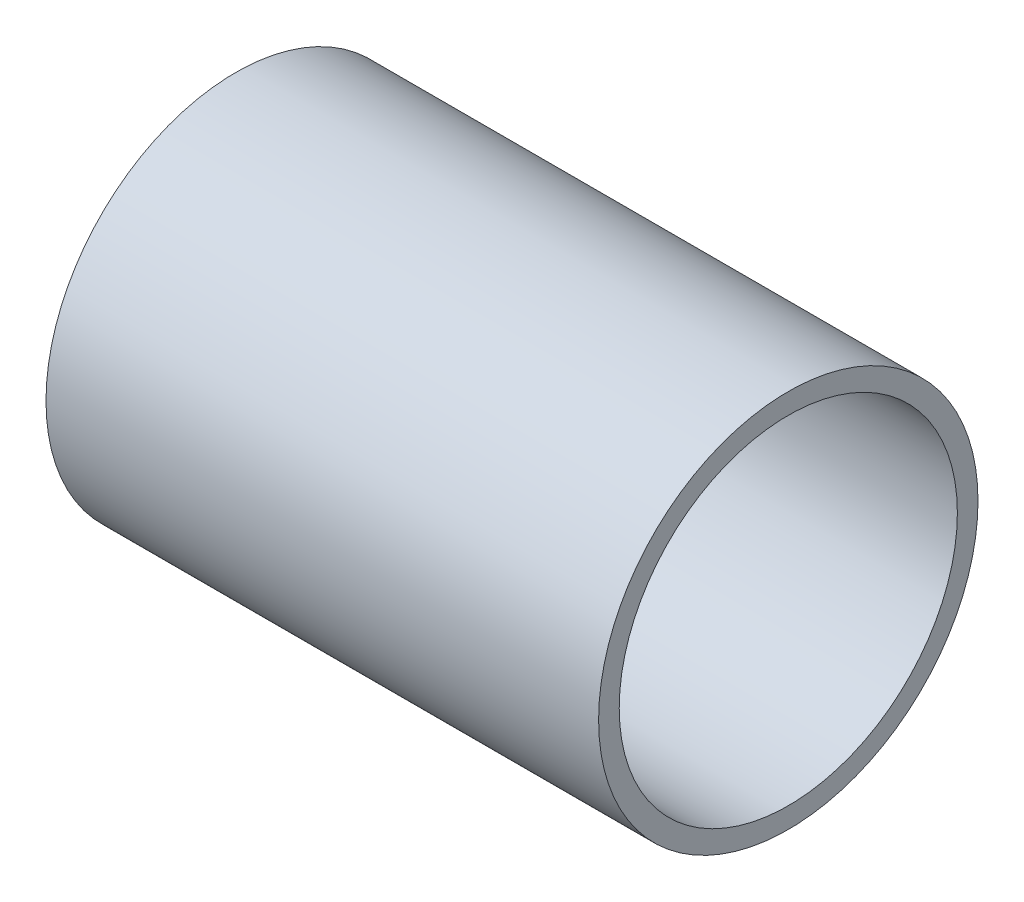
ISO-10303-21;
HEADER;
FILE_DESCRIPTION(('STEP AP214'),'2;1');
FILE_NAME('part.step','',(''),(''),'','','');
FILE_SCHEMA(('AUTOMOTIVE_DESIGN { 1 0 10303 214 1 1 1 1 }'));
ENDSEC;
DATA;
#1=APPLICATION_CONTEXT('core data for automotive mechanical design processes');
#2=APPLICATION_PROTOCOL_DEFINITION('international standard','automotive_design',2000,#1);
#3=PRODUCT_CONTEXT('',#1,'mechanical');
#4=PRODUCT('Part','Part','',(#3));
#5=PRODUCT_RELATED_PRODUCT_CATEGORY('part','',(#4));
#6=PRODUCT_DEFINITION_FORMATION('','',#4);
#7=PRODUCT_DEFINITION_CONTEXT('part definition',#1,'design');
#8=PRODUCT_DEFINITION('design','',#6,#7);
#9=PRODUCT_DEFINITION_SHAPE('','',#8);
#10=(LENGTH_UNIT() NAMED_UNIT(*) SI_UNIT(.MILLI.,.METRE.));
#11=(NAMED_UNIT(*) PLANE_ANGLE_UNIT() SI_UNIT($,.RADIAN.));
#12=(NAMED_UNIT(*) SI_UNIT($,.STERADIAN.) SOLID_ANGLE_UNIT());
#13=UNCERTAINTY_MEASURE_WITH_UNIT(LENGTH_MEASURE(1.E-05),#10,'distance_accuracy_value','');
#14=(GEOMETRIC_REPRESENTATION_CONTEXT(3) GLOBAL_UNCERTAINTY_ASSIGNED_CONTEXT((#13)) GLOBAL_UNIT_ASSIGNED_CONTEXT((#10,
#11,#12)) REPRESENTATION_CONTEXT('',''));
#15=CARTESIAN_POINT('',(0.,0.,0.));
#16=DIRECTION('',(0.,0.,1.));
#17=DIRECTION('',(1.,0.,0.));
#18=AXIS2_PLACEMENT_3D('',#15,#16,#17);
#19=CARTESIAN_POINT('',(67.,0.,0.));
#20=DIRECTION('',(1.,0.,0.));
#21=DIRECTION('',(0.,0.,-1.));
#22=AXIS2_PLACEMENT_3D('',#19,#20,#21);
#23=PLANE('',#22);
#24=CARTESIAN_POINT('',(67.,0.,0.));
#25=DIRECTION('',(1.,0.,0.));
#26=DIRECTION('',(0.,0.,-1.));
#27=AXIS2_PLACEMENT_3D('',#24,#25,#26);
#28=CIRCLE('',#27,23.);
#29=CARTESIAN_POINT('',(67.,0.,-23.));
#30=VERTEX_POINT('',#29);
#31=EDGE_CURVE('E10',#30,#30,#28,.T.);
#32=ORIENTED_EDGE('',*,*,#31,.T.);
#33=EDGE_LOOP('',(#32));
#34=FACE_BOUND('',#33,.T.);
#35=CARTESIAN_POINT('',(67.,0.,0.));
#36=DIRECTION('',(1.,0.,0.));
#37=DIRECTION('',(0.,0.,-1.));
#38=AXIS2_PLACEMENT_3D('',#35,#36,#37);
#39=CIRCLE('',#38,20.5);
#40=CARTESIAN_POINT('',(67.,0.,-20.5));
#41=VERTEX_POINT('',#40);
#42=EDGE_CURVE('E38',#41,#41,#39,.T.);
#43=ORIENTED_EDGE('',*,*,#42,.F.);
#44=EDGE_LOOP('',(#43));
#45=FACE_BOUND('',#44,.T.);
#46=ADVANCED_FACE('F27',(#34,#45),#23,.T.);
#47=CARTESIAN_POINT('',(0.,0.,0.));
#48=DIRECTION('',(1.,0.,0.));
#49=DIRECTION('',(0.,0.,-1.));
#50=AXIS2_PLACEMENT_3D('',#47,#48,#49);
#51=PLANE('',#50);
#52=CARTESIAN_POINT('',(0.,0.,0.));
#53=DIRECTION('',(1.,0.,0.));
#54=DIRECTION('',(0.,0.,-1.));
#55=AXIS2_PLACEMENT_3D('',#52,#53,#54);
#56=CIRCLE('',#55,23.);
#57=CARTESIAN_POINT('',(0.,0.,-23.));
#58=VERTEX_POINT('',#57);
#59=EDGE_CURVE('E34',#58,#58,#56,.T.);
#60=ORIENTED_EDGE('',*,*,#59,.F.);
#61=EDGE_LOOP('',(#60));
#62=FACE_BOUND('',#61,.T.);
#63=CARTESIAN_POINT('',(0.,0.,0.));
#64=DIRECTION('',(1.,0.,0.));
#65=DIRECTION('',(0.,0.,-1.));
#66=AXIS2_PLACEMENT_3D('',#63,#64,#65);
#67=CIRCLE('',#66,20.5);
#68=CARTESIAN_POINT('',(0.,0.,-20.5));
#69=VERTEX_POINT('',#68);
#70=EDGE_CURVE('E42',#69,#69,#67,.T.);
#71=ORIENTED_EDGE('',*,*,#70,.T.);
#72=EDGE_LOOP('',(#71));
#73=FACE_BOUND('',#72,.T.);
#74=ADVANCED_FACE('F48',(#62,#73),#51,.F.);
#75=CARTESIAN_POINT('',(67.,0.,0.));
#76=DIRECTION('',(-1.,0.,0.));
#77=DIRECTION('',(0.,0.,1.));
#78=AXIS2_PLACEMENT_3D('',#75,#76,#77);
#79=CYLINDRICAL_SURFACE('',#78,23.);
#80=ORIENTED_EDGE('',*,*,#31,.F.);
#81=EDGE_LOOP('',(#80));
#82=FACE_BOUND('',#81,.T.);
#83=ORIENTED_EDGE('',*,*,#59,.T.);
#84=EDGE_LOOP('',(#83));
#85=FACE_BOUND('',#84,.T.);
#86=ADVANCED_FACE('F29',(#82,#85),#79,.T.);
#87=CARTESIAN_POINT('',(67.,0.,0.));
#88=DIRECTION('',(-1.,0.,0.));
#89=DIRECTION('',(0.,0.,1.));
#90=AXIS2_PLACEMENT_3D('',#87,#88,#89);
#91=CYLINDRICAL_SURFACE('',#90,20.5);
#92=ORIENTED_EDGE('',*,*,#42,.T.);
#93=EDGE_LOOP('',(#92));
#94=FACE_BOUND('',#93,.T.);
#95=ORIENTED_EDGE('',*,*,#70,.F.);
#96=EDGE_LOOP('',(#95));
#97=FACE_BOUND('',#96,.T.);
#98=ADVANCED_FACE('F50',(#94,#97),#91,.F.);
#99=CLOSED_SHELL('',(#46,#74,#86,#98));
#100=MANIFOLD_SOLID_BREP('B2',#99);
#101=ADVANCED_BREP_SHAPE_REPRESENTATION('',(#18,#100),#14);
#102=SHAPE_DEFINITION_REPRESENTATION(#9,#101);
ENDSEC;
END-ISO-10303-21;
